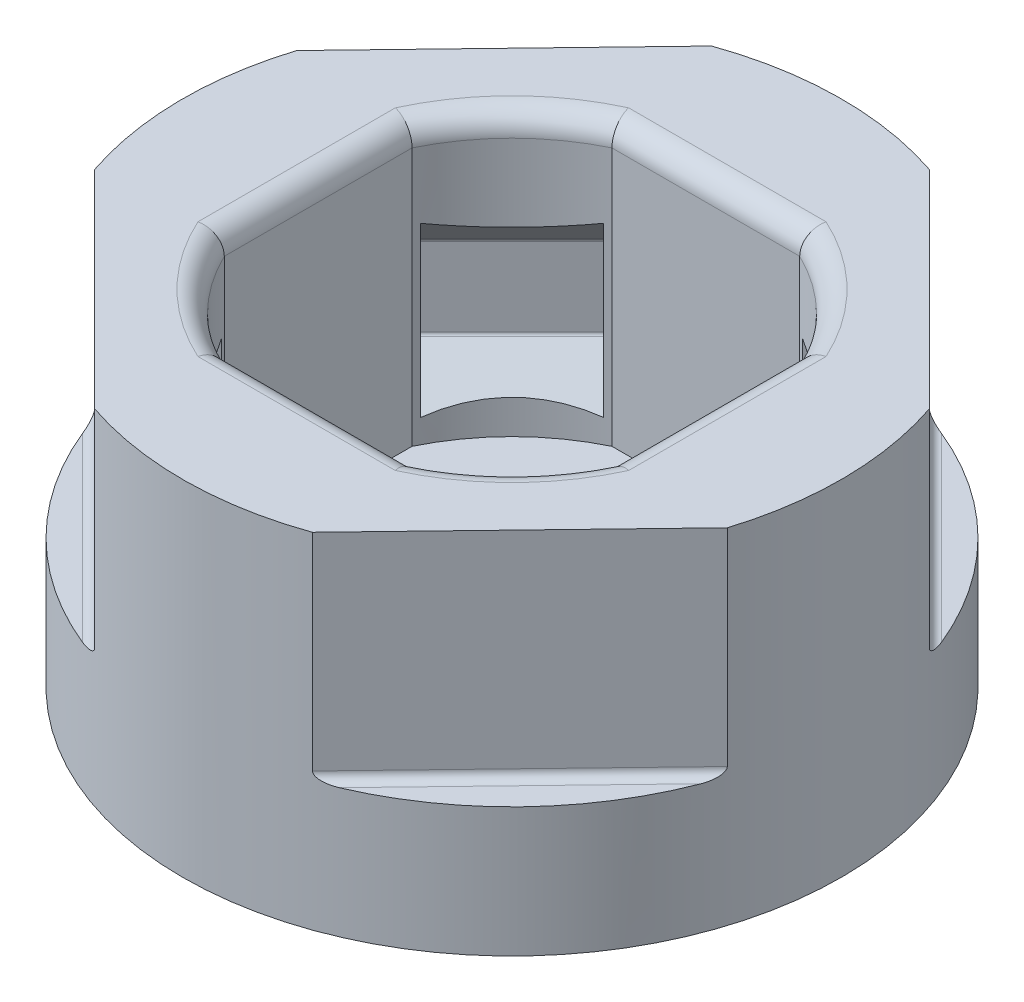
from build123d import *

# Parameters (mm, degrees)
SKETCH1_R                = 7.65
BOSS_EXTRUDE1_DEPTH      = 8
CUT_EXTRUDE1_DEPTH       = 6.5
FILLET4_R                = 0.5
CUT_EXTRUDE2_START       = -5
CUT_EXTRUDE2_DEPTH       = 5
FILLET5_R                = 0.2
FILLET6_R                = 0.1
CIRPATTERN1_COUNT        = 4
FILLET6_OF_CIRPATTERN1_R = 0.1


with BuildPart() as part:
    # Sketch1 → Boss-Extrude1 (new body)
    with BuildSketch(Plane(origin=(0, 0, 0), x_dir=(1, 0, 0), z_dir=(0, 1, 0))):
        with Locations(Location((0, 0, 0), (0, 0, 270))):
            Circle(SKETCH1_R)
    extrude(amount=BOSS_EXTRUDE1_DEPTH)

    # Sketch2 → Cut-Extrude1 (cut)
    with BuildSketch(Plane(origin=(0, 8, 0), x_dir=(1, 0, 0), z_dir=(0, 1, 0))):
        with BuildLine():
            ThreePointArc((-4.5, -2.179449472), (-3.535533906, -3.535533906), (-2.179449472, -4.5))
            Line((-2.179449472, -4.5), (2.179449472, -4.5))
            ThreePointArc((2.179449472, -4.5), (3.535533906, -3.535533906), (4.5, -2.179449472))
            Line((4.5, -2.179449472), (4.5, 2.179449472))
            ThreePointArc((4.5, 2.179449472), (3.535533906, 3.535533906), (2.179449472, 4.5))
            Line((2.179449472, 4.5), (-2.179449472, 4.5))
            ThreePointArc((-2.179449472, 4.5), (-3.535533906, 3.535533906), (-4.5, 2.179449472))
            Line((-4.5, 2.179449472), (-4.5, -2.179449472))
        make_face()
    extrude(amount=-CUT_EXTRUDE1_DEPTH, mode=Mode.SUBTRACT)

    # Fillet4
    fillet4_edges = [part.edges().sort_by_distance(p)[0] for p in [
        (-4.5, 8, 0),
        (0, 8, -4.5),
        (0, 8, 4.5),
        (3.535533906, 8, 3.535533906),
        (4.5, 8, 0),
        (3.535533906, 8, -3.535533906),
        (-3.535533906, 8, -3.535533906),
        (-3.535533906, 8, 3.535533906),
    ]]
    fillet(fillet4_edges, radius=FILLET4_R)

    # Sketch7 → Cut-Extrude2 (cut)
    with BuildSketch(Plane(origin=(0, 8, 0), x_dir=(1, 0, 0), z_dir=(0, 1, 0)).offset(CUT_EXTRUDE2_START)):
        with BuildLine():
            ThreePointArc((7.252000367, 2.435362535), (5.409366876, 5.409366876), (2.435362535, 7.252000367))
            Line((2.435362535, 7.252000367), (7.252000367, 2.435362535))
        make_face()
        with BuildLine():
            Line((-2.435362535, -7.252000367), (-7.252000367, -2.435362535))
            ThreePointArc((-7.252000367, -2.435362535), (-5.409366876, -5.409366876), (-2.435362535, -7.252000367))
        make_face()
        with BuildLine():
            ThreePointArc((-2.571963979, 7.204686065), (-5.510618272, 5.306183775), (-7.296724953, 2.297891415))
            Line((-7.296724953, 2.297891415), (-2.571963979, 7.204686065))
        make_face()
        with BuildLine():
            Line((7.296724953, -2.297891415), (2.571963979, -7.204686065))
            ThreePointArc((2.571963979, -7.204686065), (5.510618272, -5.306183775), (7.296724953, -2.297891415))
        make_face()
    extrude(amount=CUT_EXTRUDE2_DEPTH, mode=Mode.SUBTRACT)

    # Fillet5
    fillet5_edges = [part.edges().sort_by_distance(p)[0] for p in [
        (4.934344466, 3, 4.75128874),
        (-4.934344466, 3, -4.75128874),
        (-4.843681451, 3, 4.843681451),
        (4.843681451, 3, -4.843681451),
    ]]
    fillet(fillet5_edges, radius=FILLET5_R)

    # Sketch8 → Cut-Loft2 section 0
    with BuildSketch(Plane(origin=(-3.339724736, 0, -3.339724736), x_dir=(-0.7071067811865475, 0, 0.7071067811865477), z_dir=(-0.7071067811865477, 0, -0.7071067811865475))):
        with BuildLine():
            Line((-1.5, 6), (1.5, 6))
            Line((1.5, 6), (1.5, 2))
            Line((1.5, 2), (-1.5, 2))
            Line((-1.5, 2), (-1.5, 6))
        make_face()
    # Sketch9 → Cut-Loft2 section 1
    with BuildSketch(Plane(origin=(-4.046831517, 0, -4.046831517), x_dir=(-0.7071067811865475, 0, 0.7071067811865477), z_dir=(-0.7071067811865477, 0, -0.7071067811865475))):
        with BuildLine():
            Line((-1.5, 4.95), (1.5, 4.95))
            Line((1.5, 4.95), (1.5, 3.05))
            Line((1.5, 3.05), (-1.5, 3.05))
            Line((-1.5, 3.05), (-1.5, 4.95))
        make_face()
    cut_loft2 = loft(mode=Mode.SUBTRACT)

    # Fillet6
    fillet6_edges = [part.edges().sort_by_distance(p)[0] for p in [
        (-4.046831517, 4.95, -4.046831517),
        (-4.046831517, 3.05, -4.046831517),
    ]]
    fillet(fillet6_edges, radius=FILLET6_R)

    # CirPattern1: Cut-Loft2 ×4 about axis
    cirpattern1_axis = Axis((0, 0, 0), (0, 1, 0))
    for i in range(1, CIRPATTERN1_COUNT):
        add(cut_loft2.rotate(cirpattern1_axis, i * 360 / CIRPATTERN1_COUNT), mode=Mode.SUBTRACT)

    # Fillet6 of CirPattern1
    fillet6_of_cirpattern1_edges = [part.edges().sort_by_distance(p)[0] for p in [
        (-4.046831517, 4.95, 4.046831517),
        (-4.046831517, 3.05, 4.046831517),
        (4.046831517, 4.95, 4.046831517),
        (4.046831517, 3.05, 4.046831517),
        (4.046831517, 4.95, -4.046831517),
        (4.046831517, 3.05, -4.046831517),
    ]]
    fillet(fillet6_of_cirpattern1_edges, radius=FILLET6_OF_CIRPATTERN1_R)


solid = part.part
